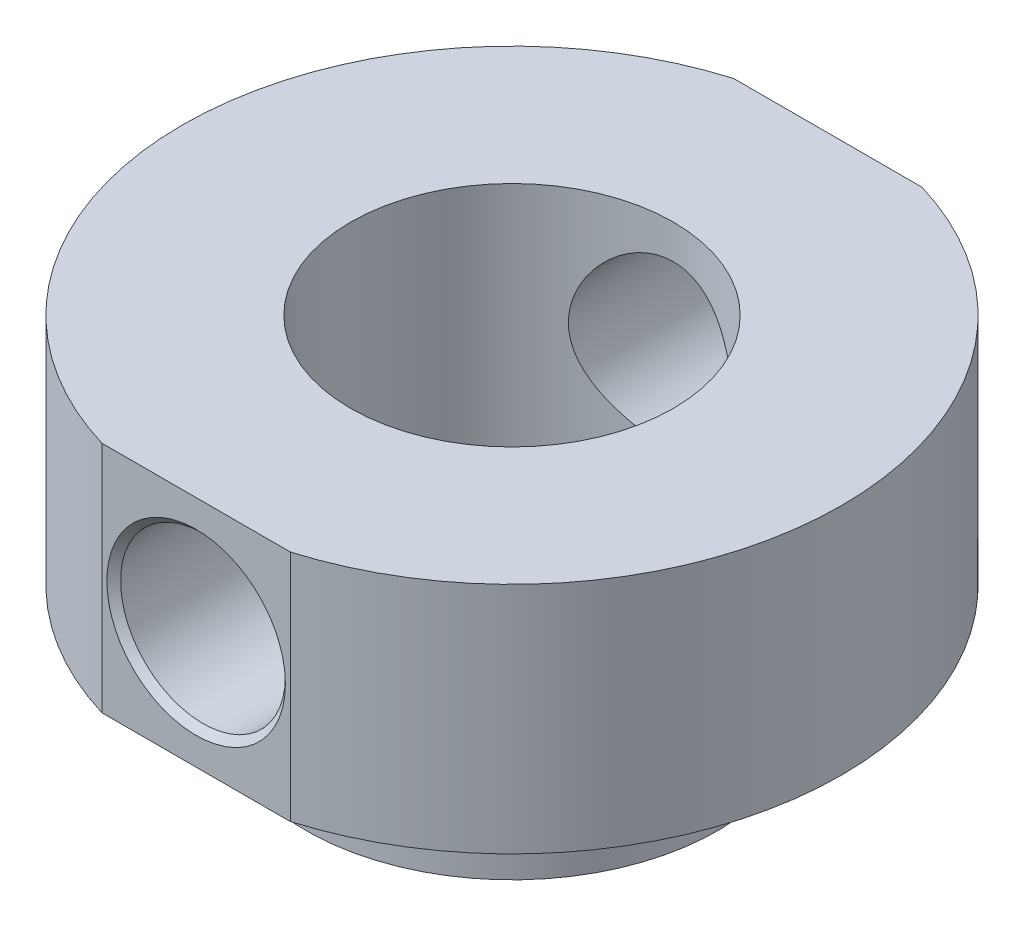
ISO-10303-21;
HEADER;
FILE_DESCRIPTION(('STEP AP214'),'2;1');
FILE_NAME('part.step','',(''),(''),'','','');
FILE_SCHEMA(('AUTOMOTIVE_DESIGN { 1 0 10303 214 1 1 1 1 }'));
ENDSEC;
DATA;
#1=APPLICATION_CONTEXT('core data for automotive mechanical design processes');
#2=APPLICATION_PROTOCOL_DEFINITION('international standard','automotive_design',2000,#1);
#3=PRODUCT_CONTEXT('',#1,'mechanical');
#4=PRODUCT('Part','Part','',(#3));
#5=PRODUCT_RELATED_PRODUCT_CATEGORY('part','',(#4));
#6=PRODUCT_DEFINITION_FORMATION('','',#4);
#7=PRODUCT_DEFINITION_CONTEXT('part definition',#1,'design');
#8=PRODUCT_DEFINITION('design','',#6,#7);
#9=PRODUCT_DEFINITION_SHAPE('','',#8);
#10=(LENGTH_UNIT() NAMED_UNIT(*) SI_UNIT(.MILLI.,.METRE.));
#11=(NAMED_UNIT(*) PLANE_ANGLE_UNIT() SI_UNIT($,.RADIAN.));
#12=(NAMED_UNIT(*) SI_UNIT($,.STERADIAN.) SOLID_ANGLE_UNIT());
#13=UNCERTAINTY_MEASURE_WITH_UNIT(LENGTH_MEASURE(1.E-05),#10,'distance_accuracy_value','');
#14=(GEOMETRIC_REPRESENTATION_CONTEXT(3) GLOBAL_UNCERTAINTY_ASSIGNED_CONTEXT((#13)) GLOBAL_UNIT_ASSIGNED_CONTEXT((#10,
#11,#12)) REPRESENTATION_CONTEXT('',''));
#15=CARTESIAN_POINT('',(0.,0.,0.));
#16=DIRECTION('',(0.,0.,1.));
#17=DIRECTION('',(1.,0.,0.));
#18=AXIS2_PLACEMENT_3D('',#15,#16,#17);
#19=CARTESIAN_POINT('',(11.7500000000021,0.,0.));
#20=DIRECTION('',(0.,-1.,0.));
#21=DIRECTION('',(0.,0.,-1.));
#22=AXIS2_PLACEMENT_3D('',#19,#20,#21);
#23=PLANE('',#22);
#24=CARTESIAN_POINT('',(0.,0.,0.));
#25=DIRECTION('',(0.,-1.,0.));
#26=DIRECTION('',(0.,0.,-1.));
#27=AXIS2_PLACEMENT_3D('',#24,#25,#26);
#28=CIRCLE('',#27,24.);
#29=CARTESIAN_POINT('',(6.85565460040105,0.,-23.));
#30=VERTEX_POINT('',#29);
#31=CARTESIAN_POINT('',(6.85565460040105,0.,23.));
#32=VERTEX_POINT('',#31);
#33=EDGE_CURVE('E95',#30,#32,#28,.T.);
#34=ORIENTED_EDGE('',*,*,#33,.T.);
#35=DIRECTION('',(1.,0.,0.));
#36=VECTOR('',#35,1.);
#37=CARTESIAN_POINT('',(25.446623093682,0.,23.0000000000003));
#38=LINE('',#37,#36);
#39=CARTESIAN_POINT('',(-6.85565460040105,0.,23.));
#40=VERTEX_POINT('',#39);
#41=EDGE_CURVE('E170',#40,#32,#38,.T.);
#42=ORIENTED_EDGE('',*,*,#41,.F.);
#43=CARTESIAN_POINT('',(-6.85565460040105,0.,-23.));
#44=VERTEX_POINT('',#43);
#45=EDGE_CURVE('E98',#40,#44,#28,.T.);
#46=ORIENTED_EDGE('',*,*,#45,.T.);
#47=DIRECTION('',(-1.,0.,0.));
#48=VECTOR('',#47,1.);
#49=CARTESIAN_POINT('',(25.446623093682,0.,-22.9999999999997));
#50=LINE('',#49,#48);
#51=EDGE_CURVE('E172',#30,#44,#50,.T.);
#52=ORIENTED_EDGE('',*,*,#51,.F.);
#53=EDGE_LOOP('',(#34,#42,#46,#52));
#54=FACE_BOUND('',#53,.T.);
#55=CARTESIAN_POINT('',(0.,0.,0.));
#56=DIRECTION('',(0.,-1.,0.));
#57=DIRECTION('',(0.,0.,-1.));
#58=AXIS2_PLACEMENT_3D('',#55,#56,#57);
#59=CIRCLE('',#58,15.);
#60=CARTESIAN_POINT('',(0.,0.,-15.));
#61=VERTEX_POINT('',#60);
#62=EDGE_CURVE('E177',#61,#61,#59,.T.);
#63=ORIENTED_EDGE('',*,*,#62,.F.);
#64=EDGE_LOOP('',(#63));
#65=FACE_BOUND('',#64,.T.);
#66=ADVANCED_FACE('F38',(#54,#65),#23,.T.);
#67=CARTESIAN_POINT('',(0.,0.,0.));
#68=DIRECTION('',(0.,-1.,0.));
#69=DIRECTION('',(0.,0.,-1.));
#70=AXIS2_PLACEMENT_3D('',#67,#68,#69);
#71=CYLINDRICAL_SURFACE('',#70,24.);
#72=ORIENTED_EDGE('',*,*,#45,.F.);
#73=DIRECTION('',(0.,-1.,0.));
#74=VECTOR('',#73,1.);
#75=CARTESIAN_POINT('',(-6.85565460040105,0.,23.));
#76=LINE('',#75,#74);
#77=CARTESIAN_POINT('',(-6.85565460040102,17.,23.));
#78=VERTEX_POINT('',#77);
#79=EDGE_CURVE('E165',#40,#78,#76,.F.);
#80=ORIENTED_EDGE('',*,*,#79,.T.);
#81=CARTESIAN_POINT('',(0.,17.,0.));
#82=DIRECTION('',(0.,-1.,0.));
#83=DIRECTION('',(0.,0.,-1.));
#84=AXIS2_PLACEMENT_3D('',#81,#82,#83);
#85=CIRCLE('',#84,24.);
#86=CARTESIAN_POINT('',(-6.85565460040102,17.,-23.));
#87=VERTEX_POINT('',#86);
#88=EDGE_CURVE('E99',#78,#87,#85,.T.);
#89=ORIENTED_EDGE('',*,*,#88,.T.);
#90=DIRECTION('',(0.,-1.,0.));
#91=VECTOR('',#90,1.);
#92=CARTESIAN_POINT('',(-6.85565460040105,0.,-23.));
#93=LINE('',#92,#91);
#94=EDGE_CURVE('E54',#87,#44,#93,.T.);
#95=ORIENTED_EDGE('',*,*,#94,.T.);
#96=EDGE_LOOP('',(#72,#80,#89,#95));
#97=FACE_BOUND('',#96,.T.);
#98=ADVANCED_FACE('F135',(#97),#71,.T.);
#99=CARTESIAN_POINT('',(6.85565460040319,17.,-22.9999999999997));
#100=VERTEX_POINT('',#99);
#101=CARTESIAN_POINT('',(6.85565460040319,17.,23.0000000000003));
#102=VERTEX_POINT('',#101);
#103=EDGE_CURVE('E93',#100,#102,#85,.T.);
#104=ORIENTED_EDGE('',*,*,#103,.T.);
#105=DIRECTION('',(0.,-1.,0.));
#106=VECTOR('',#105,1.);
#107=CARTESIAN_POINT('',(6.85565460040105,0.,23.));
#108=LINE('',#107,#106);
#109=EDGE_CURVE('E62',#102,#32,#108,.T.);
#110=ORIENTED_EDGE('',*,*,#109,.T.);
#111=ORIENTED_EDGE('',*,*,#33,.F.);
#112=DIRECTION('',(0.,-1.,0.));
#113=VECTOR('',#112,1.);
#114=CARTESIAN_POINT('',(6.85565460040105,0.,-23.));
#115=LINE('',#114,#113);
#116=EDGE_CURVE('E80',#30,#100,#115,.F.);
#117=ORIENTED_EDGE('',*,*,#116,.T.);
#118=EDGE_LOOP('',(#104,#110,#111,#117));
#119=FACE_BOUND('',#118,.T.);
#120=ADVANCED_FACE('F92',(#119),#71,.T.);
#121=CARTESIAN_POINT('',(24.,17.,1.0288742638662E-13));
#122=DIRECTION('',(0.,1.,0.));
#123=DIRECTION('',(0.,0.,1.));
#124=AXIS2_PLACEMENT_3D('',#121,#122,#123);
#125=PLANE('',#124);
#126=CARTESIAN_POINT('',(0.,17.,0.));
#127=DIRECTION('',(0.,-1.,0.));
#128=DIRECTION('',(0.,0.,-1.));
#129=AXIS2_PLACEMENT_3D('',#126,#127,#128);
#130=CIRCLE('',#129,11.75);
#131=CARTESIAN_POINT('',(0.,17.,-11.75));
#132=VERTEX_POINT('',#131);
#133=EDGE_CURVE('E103',#132,#132,#130,.T.);
#134=ORIENTED_EDGE('',*,*,#133,.T.);
#135=EDGE_LOOP('',(#134));
#136=FACE_BOUND('',#135,.T.);
#137=ORIENTED_EDGE('',*,*,#88,.F.);
#138=DIRECTION('',(1.,0.,0.));
#139=VECTOR('',#138,1.);
#140=CARTESIAN_POINT('',(25.446623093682,17.,23.0000000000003));
#141=LINE('',#140,#139);
#142=EDGE_CURVE('E86',#78,#102,#141,.T.);
#143=ORIENTED_EDGE('',*,*,#142,.T.);
#144=ORIENTED_EDGE('',*,*,#103,.F.);
#145=DIRECTION('',(-1.,0.,0.));
#146=VECTOR('',#145,1.);
#147=CARTESIAN_POINT('',(25.446623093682,17.,-22.9999999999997));
#148=LINE('',#147,#146);
#149=EDGE_CURVE('E77',#100,#87,#148,.T.);
#150=ORIENTED_EDGE('',*,*,#149,.T.);
#151=EDGE_LOOP('',(#137,#143,#144,#150));
#152=FACE_BOUND('',#151,.T.);
#153=ADVANCED_FACE('F97',(#136,#152),#125,.T.);
#154=CARTESIAN_POINT('',(0.,8.5,-24.));
#155=DIRECTION('',(0.,0.,1.));
#156=DIRECTION('',(1.,0.,0.));
#157=AXIS2_PLACEMENT_3D('',#154,#155,#156);
#158=CYLINDRICAL_SURFACE('',#157,6.);
#159=CARTESIAN_POINT('',(0.,8.5,22.5));
#160=DIRECTION('',(0.,0.,1.));
#161=DIRECTION('',(1.,0.,0.));
#162=AXIS2_PLACEMENT_3D('',#159,#160,#161);
#163=CIRCLE('',#162,6.);
#164=CARTESIAN_POINT('',(6.,8.5,22.5));
#165=VERTEX_POINT('',#164);
#166=EDGE_CURVE('E13',#165,#165,#163,.T.);
#167=ORIENTED_EDGE('',*,*,#166,.T.);
#168=EDGE_LOOP('',(#167));
#169=FACE_BOUND('',#168,.T.);
#170=CARTESIAN_POINT('',(6.00000000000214,8.49999999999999,10.1025986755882));
#171=CARTESIAN_POINT('',(5.99999963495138,8.34412689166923,10.1025991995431));
#172=CARTESIAN_POINT('',(5.99391794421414,8.18824646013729,10.1062183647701));
#173=CARTESIAN_POINT('',(5.96967428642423,7.87769736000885,10.1205574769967));
#174=CARTESIAN_POINT('',(5.95150702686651,7.72302925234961,10.1312805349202));
#175=CARTESIAN_POINT('',(5.90330542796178,7.41594368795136,10.1594420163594));
#176=CARTESIAN_POINT('',(5.87325345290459,7.26352992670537,10.1768904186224));
#177=CARTESIAN_POINT('',(5.80165388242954,6.96220643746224,10.2178770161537));
#178=CARTESIAN_POINT('',(5.76010126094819,6.81329827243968,10.2414178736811));
#179=CARTESIAN_POINT('',(5.66625141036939,6.52085045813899,10.2936366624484));
#180=CARTESIAN_POINT('',(5.6140200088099,6.37728400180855,10.3222829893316));
#181=CARTESIAN_POINT('',(5.49915594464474,6.09531936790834,10.3839315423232));
#182=CARTESIAN_POINT('',(5.43651924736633,5.95692322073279,10.4169354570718));
#183=CARTESIAN_POINT('',(5.23378538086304,5.55059353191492,10.5210764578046));
#184=CARTESIAN_POINT('',(5.07877840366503,5.29125359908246,10.5973929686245));
#185=CARTESIAN_POINT('',(4.71803482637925,4.77887253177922,10.7631481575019));
#186=CARTESIAN_POINT('',(4.50907628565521,4.52830310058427,10.8531508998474));
#187=CARTESIAN_POINT('',(4.05279758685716,4.06370572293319,11.0316455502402));
#188=CARTESIAN_POINT('',(3.8054577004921,3.84969668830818,11.1201366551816));
#189=CARTESIAN_POINT('',(3.39997419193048,3.55318590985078,11.2483246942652));
#190=CARTESIAN_POINT('',(3.25367202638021,3.45572919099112,11.2916157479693));
#191=CARTESIAN_POINT('',(2.95224914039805,3.27360663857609,11.3741412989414));
#192=CARTESIAN_POINT('',(2.79713198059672,3.18893569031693,11.4133774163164));
#193=CARTESIAN_POINT('',(2.4790763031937,3.03323400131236,11.4866580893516));
#194=CARTESIAN_POINT('',(2.31613995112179,2.96219951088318,11.520704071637));
#195=CARTESIAN_POINT('',(1.98356940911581,2.83456437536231,11.5825965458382));
#196=CARTESIAN_POINT('',(1.81393596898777,2.77796211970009,11.6104437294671));
#197=CARTESIAN_POINT('',(1.48204412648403,2.68355060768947,11.6572737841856));
#198=CARTESIAN_POINT('',(1.32016252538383,2.64466437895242,11.6767584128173));
#199=CARTESIAN_POINT('',(0.993092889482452,2.58041101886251,11.709110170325));
#200=CARTESIAN_POINT('',(0.827905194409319,2.55504250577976,11.721977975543));
#201=CARTESIAN_POINT('',(0.495678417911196,2.51817559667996,11.7407185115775));
#202=CARTESIAN_POINT('',(0.328640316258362,2.50667018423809,11.7465947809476));
#203=CARTESIAN_POINT('',(-0.00590694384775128,2.49767046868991,11.7511890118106));
#204=CARTESIAN_POINT('',(-0.173416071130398,2.500175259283,11.7499074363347));
#205=CARTESIAN_POINT('',(-0.492230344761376,2.51829125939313,11.740668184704));
#206=CARTESIAN_POINT('',(-0.643624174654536,2.53269024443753,11.7333280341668));
#207=CARTESIAN_POINT('',(-0.944553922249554,2.57287028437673,11.7129443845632));
#208=CARTESIAN_POINT('',(-1.09408924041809,2.59865491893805,11.6998990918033));
#209=CARTESIAN_POINT('',(-1.39018158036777,2.66131107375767,11.6684213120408));
#210=CARTESIAN_POINT('',(-1.53673958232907,2.69817887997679,11.6499906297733));
#211=CARTESIAN_POINT('',(-1.82605810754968,2.78263748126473,11.6081604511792));
#212=CARTESIAN_POINT('',(-1.96881715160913,2.83023238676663,11.5847590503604));
#213=CARTESIAN_POINT('',(-2.25147817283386,2.93637493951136,11.5331801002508));
#214=CARTESIAN_POINT('',(-2.39131956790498,2.99505591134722,11.5049448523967));
#215=CARTESIAN_POINT('',(-2.66549228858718,3.1224510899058,11.4445356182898));
#216=CARTESIAN_POINT('',(-2.79982160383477,3.19116891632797,11.4123602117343));
#217=CARTESIAN_POINT('',(-3.19351571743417,3.41160103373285,11.3109333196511));
#218=CARTESIAN_POINT('',(-3.44375867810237,3.57765913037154,11.2367485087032));
#219=CARTESIAN_POINT('',(-3.93829934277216,3.96157445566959,11.0736937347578));
#220=CARTESIAN_POINT('',(-4.17964012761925,4.18290293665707,10.9840971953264));
#221=CARTESIAN_POINT('',(-4.62353050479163,4.66208715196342,10.8047574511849));
#222=CARTESIAN_POINT('',(-4.82604802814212,4.91997278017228,10.7150141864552));
#223=CARTESIAN_POINT('',(-5.10327248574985,5.3397185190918,10.5844490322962));
#224=CARTESIAN_POINT('',(-5.19361048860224,5.49044185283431,10.5402900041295));
#225=CARTESIAN_POINT('',(-5.3611117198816,5.80010641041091,10.4560868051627));
#226=CARTESIAN_POINT('',(-5.43828089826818,5.95904388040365,10.4160407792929));
#227=CARTESIAN_POINT('',(-5.5786398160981,6.28412335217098,10.3415471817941));
#228=CARTESIAN_POINT('',(-5.64183812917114,6.45026086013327,10.3070961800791));
#229=CARTESIAN_POINT('',(-5.75352856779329,6.78867308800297,10.2451693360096));
#230=CARTESIAN_POINT('',(-5.80202278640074,6.96094693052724,10.2176925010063));
#231=CARTESIAN_POINT('',(-5.88031395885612,7.2962052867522,10.1728205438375));
#232=CARTESIAN_POINT('',(-5.91129760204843,7.45882826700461,10.1547940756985));
#233=CARTESIAN_POINT('',(-5.95975873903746,7.78674266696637,10.1264292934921));
#234=CARTESIAN_POINT('',(-5.97723701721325,7.95203393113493,10.116090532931));
#235=CARTESIAN_POINT('',(-5.99840038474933,8.28369594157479,10.1035560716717));
#236=CARTESIAN_POINT('',(-6.00209466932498,8.45006589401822,10.1013549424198));
#237=CARTESIAN_POINT('',(-5.9956527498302,8.78243543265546,10.1051800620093));
#238=CARTESIAN_POINT('',(-5.98551757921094,8.94843504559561,10.1112056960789));
#239=CARTESIAN_POINT('',(-5.95357460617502,9.2592284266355,10.1300414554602));
#240=CARTESIAN_POINT('',(-5.93326933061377,9.40423330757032,10.1419764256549));
#241=CARTESIAN_POINT('',(-5.8822488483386,9.69184163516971,10.1716527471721));
#242=CARTESIAN_POINT('',(-5.85153022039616,9.834444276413,10.1893960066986));
#243=CARTESIAN_POINT('',(-5.78002242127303,10.1163154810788,10.2301285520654));
#244=CARTESIAN_POINT('',(-5.7392344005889,10.2555844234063,10.2531172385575));
#245=CARTESIAN_POINT('',(-5.64798285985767,10.5300836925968,10.3036646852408));
#246=CARTESIAN_POINT('',(-5.59751555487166,10.6653124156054,10.3312252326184));
#247=CARTESIAN_POINT('',(-5.42718542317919,11.0760437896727,10.4223440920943));
#248=CARTESIAN_POINT('',(-5.291638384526,11.3437923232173,10.4923972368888));
#249=CARTESIAN_POINT('',(-4.98382696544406,11.854176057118,10.6420488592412));
#250=CARTESIAN_POINT('',(-4.81154367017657,12.0967982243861,10.7216522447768));
#251=CARTESIAN_POINT('',(-4.40847859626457,12.5838741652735,10.894127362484));
#252=CARTESIAN_POINT('',(-4.17296921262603,12.8243052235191,10.9873588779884));
#253=CARTESIAN_POINT('',(-3.66342968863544,13.2636457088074,11.1675695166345));
#254=CARTESIAN_POINT('',(-3.38938478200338,13.4625391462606,11.2545462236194));
#255=CARTESIAN_POINT('',(-2.94946039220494,13.7279377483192,11.3748590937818));
#256=CARTESIAN_POINT('',(-2.79541524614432,13.8119307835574,11.4137844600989));
#257=CARTESIAN_POINT('',(-2.47959886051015,13.9664840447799,11.4865261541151));
#258=CARTESIAN_POINT('',(-2.31783109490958,14.0370502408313,11.5203447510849));
#259=CARTESIAN_POINT('',(-1.98776828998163,14.1639235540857,11.5818589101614));
#260=CARTESIAN_POINT('',(-1.81947658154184,14.2202378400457,11.6095575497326));
#261=CARTESIAN_POINT('',(-1.47763410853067,14.317918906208,11.657996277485));
#262=CARTESIAN_POINT('',(-1.30408400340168,14.3592875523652,11.6787372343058));
#263=CARTESIAN_POINT('',(-0.969806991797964,14.4233140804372,11.7109975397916));
#264=CARTESIAN_POINT('',(-0.809412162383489,14.4473674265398,11.7232015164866));
#265=CARTESIAN_POINT('',(-0.486843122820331,14.4824155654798,11.7410206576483));
#266=CARTESIAN_POINT('',(-0.324669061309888,14.4934114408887,11.7466363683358));
#267=CARTESIAN_POINT('',(7.7351891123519E-05,14.5021977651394,11.7511218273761));
#268=CARTESIAN_POINT('',(0.162649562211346,14.4999923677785,11.7499936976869));
#269=CARTESIAN_POINT('',(0.486890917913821,14.4824154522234,11.7410279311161));
#270=CARTESIAN_POINT('',(0.648560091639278,14.4670443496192,11.7331905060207));
#271=CARTESIAN_POINT('',(0.95828830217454,14.4248928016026,11.711812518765));
#272=CARTESIAN_POINT('',(1.10649982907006,14.3989982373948,11.6987155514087));
#273=CARTESIAN_POINT('',(1.4000694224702,14.336295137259,11.6672235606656));
#274=CARTESIAN_POINT('',(1.54542656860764,14.2994831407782,11.6488268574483));
#275=CARTESIAN_POINT('',(1.83229227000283,14.2153340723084,11.6071619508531));
#276=CARTESIAN_POINT('',(1.97380191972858,14.1680000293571,11.5838951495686));
#277=CARTESIAN_POINT('',(2.25226949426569,14.0632207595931,11.5329887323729));
#278=CARTESIAN_POINT('',(2.38922562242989,14.0057715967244,11.5053474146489));
#279=CARTESIAN_POINT('',(2.66335569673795,13.8786879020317,11.4450655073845));
#280=CARTESIAN_POINT('',(2.80030795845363,13.8086500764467,11.4122663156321));
#281=CARTESIAN_POINT('',(3.0678174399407,13.6586850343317,11.3432847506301));
#282=CARTESIAN_POINT('',(3.19837246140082,13.5787544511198,11.3071012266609));
#283=CARTESIAN_POINT('',(3.57952577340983,13.3249482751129,11.194620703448));
#284=CARTESIAN_POINT('',(3.81974647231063,13.1369955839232,11.1143630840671));
#285=CARTESIAN_POINT('',(4.29150573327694,12.7065653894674,10.9414344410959));
#286=CARTESIAN_POINT('',(4.51959231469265,12.4604633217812,10.8483369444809));
#287=CARTESIAN_POINT('',(4.82913721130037,12.0647682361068,10.7123630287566));
#288=CARTESIAN_POINT('',(4.92695834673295,11.928316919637,10.6676134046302));
#289=CARTESIAN_POINT('',(5.11117911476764,11.6470763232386,10.580581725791));
#290=CARTESIAN_POINT('',(5.19757707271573,11.5022858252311,10.5383000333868));
#291=CARTESIAN_POINT('',(5.36136538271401,11.1993610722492,10.4559550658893));
#292=CARTESIAN_POINT('',(5.43827760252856,11.0409272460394,10.4160410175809));
#293=CARTESIAN_POINT('',(5.57822598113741,10.7168714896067,10.3417683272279));
#294=CARTESIAN_POINT('',(5.64126929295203,10.5512533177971,10.3074068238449));
#295=CARTESIAN_POINT('',(5.75260325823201,10.2143367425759,10.2456870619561));
#296=CARTESIAN_POINT('',(5.80093155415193,10.0430540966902,10.2183109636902));
#297=CARTESIAN_POINT('',(5.88230862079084,9.69590538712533,10.171684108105));
#298=CARTESIAN_POINT('',(5.91536790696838,9.52004256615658,10.1524277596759));
#299=CARTESIAN_POINT('',(5.96027525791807,9.20349299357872,10.1261112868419));
#300=CARTESIAN_POINT('',(5.97515545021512,9.06337195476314,10.1173191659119));
#301=CARTESIAN_POINT('',(5.99501831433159,8.78216931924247,10.1055624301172));
#302=CARTESIAN_POINT('',(6.00000033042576,8.64108765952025,10.1025982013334));
#303=CARTESIAN_POINT('',(6.00000000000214,8.49999999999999,10.1025986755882));
#304=B_SPLINE_CURVE_WITH_KNOTS('',3,(#170,#171,#172,#173,#174,#175,#176,#177,#178,#179,#180,
#181,#182,#183,#184,#185,#186,#187,#188,#189,#190,#191,#192,#193,#194,#195,#196,#197,#198,#199,
#200,#201,#202,#203,#204,#205,#206,#207,#208,#209,#210,#211,#212,#213,#214,#215,#216,#217,#218,
#219,#220,#221,#222,#223,#224,#225,#226,#227,#228,#229,#230,#231,#232,#233,#234,#235,#236,#237,
#238,#239,#240,#241,#242,#243,#244,#245,#246,#247,#248,#249,#250,#251,#252,#253,#254,#255,#256,
#257,#258,#259,#260,#261,#262,#263,#264,#265,#266,#267,#268,#269,#270,#271,#272,#273,#274,#275,
#276,#277,#278,#279,#280,#281,#282,#283,#284,#285,#286,#287,#288,#289,#290,#291,#292,#293,#294,
#295,#296,#297,#298,#299,#300,#301,#302,#303),.UNSPECIFIED.,.T.,.F.,(4,2,2,2,2,2,2,2,2,2,2,2,2,
2,2,2,2,2,2,2,2,2,2,2,2,2,2,2,2,2,2,2,2,2,2,2,2,2,2,2,2,2,2,2,2,2,2,2,2,2,2,2,2,2,2,2,2,2,2,2,2,
2,2,2,2,2,4),(0.,0.467473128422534,0.935151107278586,1.40352569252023,1.87210529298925,
2.33787908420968,2.8038339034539,3.73490312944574,4.74626222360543,5.75814289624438,
6.30067512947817,6.84298975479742,7.385155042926,7.92725980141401,8.42944389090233,
8.93157663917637,9.43345513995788,9.93530117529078,10.3915236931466,10.8478897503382,
11.3041030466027,11.7604914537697,12.2227651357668,12.6852059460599,13.6095331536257,
14.6239549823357,15.639211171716,16.1821804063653,16.7249036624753,17.2672929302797,
17.8096049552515,18.3084689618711,18.8073039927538,19.305806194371,19.8042711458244,
20.2444835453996,20.6848407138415,21.1251475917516,21.565626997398,22.4861931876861,
23.4072345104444,24.4504002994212,25.4939669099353,26.0325154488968,26.5708239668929,
27.1088611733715,27.6468311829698,28.1341243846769,28.6213771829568,29.1084766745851,
29.5955607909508,30.0481217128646,30.5008262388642,30.9534006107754,31.4061514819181,
31.8774812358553,32.3489718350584,33.2915042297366,34.3312667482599,34.8520479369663,
35.3729053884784,35.9139246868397,36.4546642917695,36.9940087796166,37.5329812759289,
37.9560838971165,38.3792145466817),.UNSPECIFIED.);
#305=CARTESIAN_POINT('',(6.00000000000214,8.49999999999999,10.1025986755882));
#306=VERTEX_POINT('',#305);
#307=EDGE_CURVE('E160',#306,#306,#304,.T.);
#308=ORIENTED_EDGE('',*,*,#307,.T.);
#309=EDGE_LOOP('',(#308));
#310=FACE_BOUND('',#309,.T.);
#311=ADVANCED_FACE('F147',(#169,#310),#158,.F.);
#312=CARTESIAN_POINT('',(0.,8.5,-22.5));
#313=DIRECTION('',(0.,0.,-1.));
#314=DIRECTION('',(-1.,0.,0.));
#315=AXIS2_PLACEMENT_3D('',#312,#313,#314);
#316=CIRCLE('',#315,6.);
#317=CARTESIAN_POINT('',(-6.,8.5,-22.5));
#318=VERTEX_POINT('',#317);
#319=EDGE_CURVE('E110',#318,#318,#316,.T.);
#320=ORIENTED_EDGE('',*,*,#319,.T.);
#321=EDGE_LOOP('',(#320));
#322=FACE_BOUND('',#321,.T.);
#323=CARTESIAN_POINT('',(0.,14.5,-11.7500000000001));
#324=CARTESIAN_POINT('',(-0.157379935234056,14.4999997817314,-11.7499997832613));
#325=CARTESIAN_POINT('',(-0.314764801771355,14.4938010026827,-11.7468309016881));
#326=CARTESIAN_POINT('',(-0.628370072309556,14.46907894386,-11.7342358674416));
#327=CARTESIAN_POINT('',(-0.784589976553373,14.4505506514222,-11.7248071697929));
#328=CARTESIAN_POINT('',(-1.09483052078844,14.4013596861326,-11.6999186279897));
#329=CARTESIAN_POINT('',(-1.24884795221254,14.37068087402,-11.6844507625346));
#330=CARTESIAN_POINT('',(-1.553429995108,14.2975339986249,-11.6478709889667));
#331=CARTESIAN_POINT('',(-1.70399316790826,14.255061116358,-11.6267567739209));
#332=CARTESIAN_POINT('',(-1.99996915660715,14.158994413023,-11.5795066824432));
#333=CARTESIAN_POINT('',(-2.14540171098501,14.1054503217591,-11.5533932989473));
#334=CARTESIAN_POINT('',(-2.43097829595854,13.9876441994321,-11.4966988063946));
#335=CARTESIAN_POINT('',(-2.57112030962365,13.9233781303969,-11.4661160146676));
#336=CARTESIAN_POINT('',(-2.98231509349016,13.7153605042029,-11.3687022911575));
#337=CARTESIAN_POINT('',(-3.24445421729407,13.5562853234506,-11.2961530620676));
#338=CARTESIAN_POINT('',(-3.75511093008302,13.1908411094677,-11.1372232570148));
#339=CARTESIAN_POINT('',(-4.0017620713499,12.9821428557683,-11.0502625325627));
#340=CARTESIAN_POINT('',(-4.45841751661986,12.5281662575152,-10.8740472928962));
#341=CARTESIAN_POINT('',(-4.66839259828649,12.2828590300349,-10.7847910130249));
#342=CARTESIAN_POINT('',(-4.96018300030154,11.8804026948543,-10.6523150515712));
#343=CARTESIAN_POINT('',(-5.05661893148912,11.7344004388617,-10.606750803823));
#344=CARTESIAN_POINT('',(-5.2367422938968,11.4338014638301,-10.5189850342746));
#345=CARTESIAN_POINT('',(-5.32043513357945,11.2792084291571,-10.4767820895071));
#346=CARTESIAN_POINT('',(-5.47432921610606,10.9622668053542,-10.3971984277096));
#347=CARTESIAN_POINT('',(-5.54453140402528,10.79991876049,-10.3598173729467));
#348=CARTESIAN_POINT('',(-5.6706370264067,10.4685700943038,-10.2913326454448));
#349=CARTESIAN_POINT('',(-5.72654908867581,10.2995735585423,-10.2602251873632));
#350=CARTESIAN_POINT('',(-5.82043836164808,9.966493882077,-10.2072390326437));
#351=CARTESIAN_POINT('',(-5.8592939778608,9.80272927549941,-10.18491683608));
#352=CARTESIAN_POINT('',(-5.9231815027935,9.47175342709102,-10.147895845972));
#353=CARTESIAN_POINT('',(-5.94822090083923,9.30454410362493,-10.1331929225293));
#354=CARTESIAN_POINT('',(-5.98409357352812,8.96819754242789,-10.1120502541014));
#355=CARTESIAN_POINT('',(-5.99493630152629,8.79906166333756,-10.1056050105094));
#356=CARTESIAN_POINT('',(-6.0022588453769,8.46037736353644,-10.1012578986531));
#357=CARTESIAN_POINT('',(-5.99874013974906,8.29082898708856,-10.1033551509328));
#358=CARTESIAN_POINT('',(-5.97875881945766,7.97434216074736,-10.1151889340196));
#359=CARTESIAN_POINT('',(-5.96398901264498,7.82725538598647,-10.1239260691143));
#360=CARTESIAN_POINT('',(-5.92372850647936,7.53501075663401,-10.147535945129));
#361=CARTESIAN_POINT('',(-5.8982344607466,7.38985351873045,-10.1624106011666));
#362=CARTESIAN_POINT('',(-5.83682461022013,7.10248051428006,-10.1978052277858));
#363=CARTESIAN_POINT('',(-5.80090987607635,6.96026444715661,-10.2183246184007));
#364=CARTESIAN_POINT('',(-5.71903966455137,6.67956255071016,-10.2643696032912));
#365=CARTESIAN_POINT('',(-5.67308023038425,6.54107821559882,-10.2898971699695));
#366=CARTESIAN_POINT('',(-5.51843482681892,6.12614587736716,-10.3741704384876));
#367=CARTESIAN_POINT('',(-5.39436452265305,5.85664528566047,-10.4397668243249));
#368=CARTESIAN_POINT('',(-5.10963272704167,5.34111015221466,-10.5820323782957));
#369=CARTESIAN_POINT('',(-4.94895478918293,5.09508622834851,-10.6587065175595));
#370=CARTESIAN_POINT('',(-4.5706721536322,4.59887440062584,-10.8268087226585));
#371=CARTESIAN_POINT('',(-4.34833831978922,4.35248507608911,-10.9188427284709));
#372=CARTESIAN_POINT('',(-3.86505029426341,3.89878659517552,-11.0991101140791));
#373=CARTESIAN_POINT('',(-3.60407622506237,3.69149767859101,-11.1873415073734));
#374=CARTESIAN_POINT('',(-3.18071755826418,3.40943803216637,-11.3123292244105));
#375=CARTESIAN_POINT('',(-3.03026256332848,3.31843788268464,-11.3536555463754));
#376=CARTESIAN_POINT('',(-2.72103527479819,3.14958351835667,-11.4317032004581));
#377=CARTESIAN_POINT('',(-2.56226653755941,3.07172374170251,-11.4684264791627));
#378=CARTESIAN_POINT('',(-2.23751531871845,2.92999938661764,-11.5361838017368));
#379=CARTESIAN_POINT('',(-2.07153593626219,2.86612886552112,-11.5672202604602));
#380=CARTESIAN_POINT('',(-1.73355909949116,2.7531307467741,-11.6226752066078));
#381=CARTESIAN_POINT('',(-1.56156237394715,2.7040013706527,-11.6470944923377));
#382=CARTESIAN_POINT('',(-1.22786941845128,2.6246961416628,-11.6867712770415));
#383=CARTESIAN_POINT('',(-1.06654295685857,2.59326272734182,-11.7026317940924));
#384=CARTESIAN_POINT('',(-0.741353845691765,2.54370607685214,-11.7277226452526));
#385=CARTESIAN_POINT('',(-0.577491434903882,2.52558159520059,-11.7369535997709));
#386=CARTESIAN_POINT('',(-0.248654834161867,2.50289041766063,-11.748520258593));
#387=CARTESIAN_POINT('',(-0.0836811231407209,2.49831821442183,-11.7508587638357));
#388=CARTESIAN_POINT('',(0.246030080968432,2.50278005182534,-11.7485804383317));
#389=CARTESIAN_POINT('',(0.41076758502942,2.51181343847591,-11.7439639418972));
#390=CARTESIAN_POINT('',(0.725166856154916,2.5420644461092,-11.7285696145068));
#391=CARTESIAN_POINT('',(0.87495832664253,2.56222358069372,-11.7183273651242));
#392=CARTESIAN_POINT('',(1.17217824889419,2.61368102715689,-11.6923375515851));
#393=CARTESIAN_POINT('',(1.31960593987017,2.64498285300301,-11.6765882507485));
#394=CARTESIAN_POINT('',(1.6110411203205,2.71838069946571,-11.6399575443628));
#395=CARTESIAN_POINT('',(1.75504966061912,2.76047335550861,-11.6190777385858));
#396=CARTESIAN_POINT('',(2.03888772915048,2.8550618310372,-11.5726457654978));
#397=CARTESIAN_POINT('',(2.17871560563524,2.90756170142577,-11.5470917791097));
#398=CARTESIAN_POINT('',(2.45712253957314,3.02405897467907,-11.491116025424));
#399=CARTESIAN_POINT('',(2.59556425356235,3.0883301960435,-11.4605807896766));
#400=CARTESIAN_POINT('',(2.8665014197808,3.22682827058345,-11.3958370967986));
#401=CARTESIAN_POINT('',(2.99899483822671,3.30105849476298,-11.3616273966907));
#402=CARTESIAN_POINT('',(3.38658319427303,3.53787675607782,-11.2545658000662));
#403=CARTESIAN_POINT('',(3.63193333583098,3.71465445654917,-11.1772506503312));
#404=CARTESIAN_POINT('',(4.11570550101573,4.1215566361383,-11.0088871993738));
#405=CARTESIAN_POINT('',(4.35090547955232,4.35527188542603,-10.9172412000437));
#406=CARTESIAN_POINT('',(4.67272371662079,4.73263124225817,-10.7815488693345));
#407=CARTESIAN_POINT('',(4.77489780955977,4.86298993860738,-10.7365811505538));
#408=CARTESIAN_POINT('',(4.96841458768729,5.13216434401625,-10.6484103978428));
#409=CARTESIAN_POINT('',(5.05975558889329,5.27098136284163,-10.6052076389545));
#410=CARTESIAN_POINT('',(5.23562496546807,5.56418107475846,-10.5195448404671));
#411=CARTESIAN_POINT('',(5.31950992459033,5.71899979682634,-10.4772538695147));
#412=CARTESIAN_POINT('',(5.47372042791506,6.03636689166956,-10.3975198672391));
#413=CARTESIAN_POINT('',(5.5440525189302,6.19891148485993,-10.3600744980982));
#414=CARTESIAN_POINT('',(5.67036414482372,6.53062496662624,-10.2914837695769));
#415=CARTESIAN_POINT('',(5.72635572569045,6.69978815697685,-10.2603331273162));
#416=CARTESIAN_POINT('',(5.82328828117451,7.04356889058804,-10.2056318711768));
#417=CARTESIAN_POINT('',(5.86423170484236,7.21818554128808,-10.1820800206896));
#418=CARTESIAN_POINT('',(5.92719926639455,7.55415677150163,-10.1455408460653));
#419=CARTESIAN_POINT('',(5.95067443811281,7.71515273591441,-10.1317497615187));
#420=CARTESIAN_POINT('',(5.98447704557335,8.03899050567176,-10.1118210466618));
#421=CARTESIAN_POINT('',(5.99480539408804,8.20183218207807,-10.1056828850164));
#422=CARTESIAN_POINT('',(6.00214959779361,8.52785147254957,-10.1013226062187));
#423=CARTESIAN_POINT('',(5.99917112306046,8.69102891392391,-10.1030971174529));
#424=CARTESIAN_POINT('',(5.97996325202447,9.01631797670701,-10.1144779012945));
#425=CARTESIAN_POINT('',(5.96373449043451,9.17842964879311,-10.1240837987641));
#426=CARTESIAN_POINT('',(5.92063511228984,9.48350966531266,-10.1493413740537));
#427=CARTESIAN_POINT('',(5.89504144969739,9.62672103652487,-10.1642634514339));
#428=CARTESIAN_POINT('',(5.8337097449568,9.91028417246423,-10.1995867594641));
#429=CARTESIAN_POINT('',(5.79796835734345,10.0506349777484,-10.2199897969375));
#430=CARTESIAN_POINT('',(5.67605300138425,10.4661131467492,-10.2885229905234));
#431=CARTESIAN_POINT('',(5.57516027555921,10.7358575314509,-10.3439943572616));
#432=CARTESIAN_POINT('',(5.32960105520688,11.2727912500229,-10.4727355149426));
#433=CARTESIAN_POINT('',(5.18246177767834,11.5386076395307,-10.5469463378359));
#434=CARTESIAN_POINT('',(4.85124157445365,12.043549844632,-10.7033430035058));
#435=CARTESIAN_POINT('',(4.66714105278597,12.282661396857,-10.7855330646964));
#436=CARTESIAN_POINT('',(4.23930658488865,12.7595180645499,-10.9613268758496));
#437=CARTESIAN_POINT('',(3.99094730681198,12.9931272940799,-11.0550382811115));
#438=CARTESIAN_POINT('',(3.59020374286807,13.3103626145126,-11.1889647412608));
#439=CARTESIAN_POINT('',(3.45179191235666,13.41064916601,-11.2325343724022));
#440=CARTESIAN_POINT('',(3.16622649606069,13.5994373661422,-11.3163421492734));
#441=CARTESIAN_POINT('',(3.01907690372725,13.6879443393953,-11.3565817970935));
#442=CARTESIAN_POINT('',(2.71493295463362,13.8534566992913,-11.433133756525));
#443=CARTESIAN_POINT('',(2.55783778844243,13.9303028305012,-11.4693900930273));
#444=CARTESIAN_POINT('',(2.23659759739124,14.0703057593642,-11.5363350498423));
#445=CARTESIAN_POINT('',(2.07245608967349,14.133469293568,-11.5670264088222));
#446=CARTESIAN_POINT('',(1.73863230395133,14.2452654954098,-11.6218848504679));
#447=CARTESIAN_POINT('',(1.56896270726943,14.2939291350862,-11.6460658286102));
#448=CARTESIAN_POINT('',(1.22524510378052,14.3762209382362,-11.6872237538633));
#449=CARTESIAN_POINT('',(1.05119976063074,14.4098580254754,-11.7042049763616));
#450=CARTESIAN_POINT('',(0.731084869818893,14.4570887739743,-11.7281318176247));
#451=CARTESIAN_POINT('',(0.585468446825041,14.4731645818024,-11.7363159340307));
#452=CARTESIAN_POINT('',(0.293236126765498,14.4946204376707,-11.7472501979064));
#453=CARTESIAN_POINT('',(0.14662020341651,14.500000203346,-11.750000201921));
#454=CARTESIAN_POINT('',(0.,14.5,-11.7500000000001));
#455=B_SPLINE_CURVE_WITH_KNOTS('',3,(#323,#324,#325,#326,#327,#328,#329,#330,#331,#332,#333,
#334,#335,#336,#337,#338,#339,#340,#341,#342,#343,#344,#345,#346,#347,#348,#349,#350,#351,#352,
#353,#354,#355,#356,#357,#358,#359,#360,#361,#362,#363,#364,#365,#366,#367,#368,#369,#370,#371,
#372,#373,#374,#375,#376,#377,#378,#379,#380,#381,#382,#383,#384,#385,#386,#387,#388,#389,#390,
#391,#392,#393,#394,#395,#396,#397,#398,#399,#400,#401,#402,#403,#404,#405,#406,#407,#408,#409,
#410,#411,#412,#413,#414,#415,#416,#417,#418,#419,#420,#421,#422,#423,#424,#425,#426,#427,#428,
#429,#430,#431,#432,#433,#434,#435,#436,#437,#438,#439,#440,#441,#442,#443,#444,#445,#446,#447,
#448,#449,#450,#451,#452,#453,#454),.UNSPECIFIED.,.T.,.F.,(4,2,2,2,2,2,2,2,2,2,2,2,2,2,2,2,2,2,
2,2,2,2,2,2,2,2,2,2,2,2,2,2,2,2,2,2,2,2,2,2,2,2,2,2,2,2,2,2,2,2,2,2,2,2,2,2,2,2,2,2,2,2,2,2,2,
4),(0.,0.471995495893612,0.944183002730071,1.41699982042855,1.8900101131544,2.36094017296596,
2.83204799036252,3.77325990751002,4.77311721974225,5.77376758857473,6.31563210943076,
6.85726600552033,7.39886194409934,7.94013011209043,8.44874843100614,8.9570907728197,
9.46509444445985,9.97304581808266,10.4167745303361,10.8606418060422,11.3044634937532,
11.74846032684,12.6561143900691,13.564177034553,14.5930189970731,15.6223920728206,
16.1636597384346,16.7046977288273,17.2455054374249,17.7862478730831,18.2809520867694,
18.7756099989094,19.2700668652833,19.7644999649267,20.2184388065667,20.6725209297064,
21.1264616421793,21.5805793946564,22.047045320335,22.5136695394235,23.4464354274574,
24.4737319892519,24.9881523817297,25.5026526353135,26.0452183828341,26.5875213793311,
27.1293673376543,27.6711250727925,28.1602780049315,28.6493969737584,29.138307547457,
29.6271947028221,30.0654235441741,30.5037970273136,31.3799686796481,32.3146368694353,
33.2498019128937,34.3053146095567,34.8339717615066,35.3623891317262,35.8974754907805,
36.4322978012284,36.9659693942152,37.499323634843,37.9390381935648,38.3787643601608),.UNSPECIFIED.);
#456=CARTESIAN_POINT('',(0.,14.5,-11.7500000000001));
#457=VERTEX_POINT('',#456);
#458=EDGE_CURVE('E156',#457,#457,#455,.T.);
#459=ORIENTED_EDGE('',*,*,#458,.T.);
#460=EDGE_LOOP('',(#459));
#461=FACE_BOUND('',#460,.T.);
#462=ADVANCED_FACE('F152',(#322,#461),#158,.F.);
#463=CARTESIAN_POINT('',(0.,0.,0.));
#464=DIRECTION('',(0.,-1.,0.));
#465=DIRECTION('',(0.,0.,-1.));
#466=AXIS2_PLACEMENT_3D('',#463,#464,#465);
#467=CYLINDRICAL_SURFACE('',#466,11.75);
#468=ORIENTED_EDGE('',*,*,#458,.F.);
#469=EDGE_LOOP('',(#468));
#470=FACE_BOUND('',#469,.T.);
#471=ORIENTED_EDGE('',*,*,#307,.F.);
#472=EDGE_LOOP('',(#471));
#473=FACE_BOUND('',#472,.T.);
#474=ORIENTED_EDGE('',*,*,#133,.F.);
#475=EDGE_LOOP('',(#474));
#476=FACE_BOUND('',#475,.T.);
#477=CARTESIAN_POINT('',(2.13717932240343E-12,-8.00000000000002,0.));
#478=DIRECTION('',(0.,-1.,0.));
#479=DIRECTION('',(0.,0.,-1.));
#480=AXIS2_PLACEMENT_3D('',#477,#478,#479);
#481=CIRCLE('',#480,11.75);
#482=CARTESIAN_POINT('',(2.08579899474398E-12,-8.00000000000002,-11.75));
#483=VERTEX_POINT('',#482);
#484=EDGE_CURVE('E180',#483,#483,#481,.T.);
#485=ORIENTED_EDGE('',*,*,#484,.T.);
#486=EDGE_LOOP('',(#485));
#487=FACE_BOUND('',#486,.T.);
#488=ADVANCED_FACE('F40',(#470,#473,#476,#487),#467,.F.);
#489=CARTESIAN_POINT('',(25.446623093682,0.,-22.9999999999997));
#490=DIRECTION('',(0.,0.,-1.));
#491=DIRECTION('',(-1.,0.,0.));
#492=AXIS2_PLACEMENT_3D('',#489,#490,#491);
#493=PLANE('',#492);
#494=CARTESIAN_POINT('',(0.,8.5,-23.));
#495=DIRECTION('',(0.,0.,-1.));
#496=DIRECTION('',(-1.,0.,0.));
#497=AXIS2_PLACEMENT_3D('',#494,#495,#496);
#498=CIRCLE('',#497,6.5);
#499=CARTESIAN_POINT('',(-6.5,8.5,-23.));
#500=VERTEX_POINT('',#499);
#501=EDGE_CURVE('E107',#500,#500,#498,.F.);
#502=ORIENTED_EDGE('',*,*,#501,.T.);
#503=EDGE_LOOP('',(#502));
#504=FACE_BOUND('',#503,.T.);
#505=ORIENTED_EDGE('',*,*,#51,.T.);
#506=ORIENTED_EDGE('',*,*,#94,.F.);
#507=ORIENTED_EDGE('',*,*,#149,.F.);
#508=ORIENTED_EDGE('',*,*,#116,.F.);
#509=EDGE_LOOP('',(#505,#506,#507,#508));
#510=FACE_BOUND('',#509,.T.);
#511=ADVANCED_FACE('F79',(#504,#510),#493,.T.);
#512=CARTESIAN_POINT('',(25.446623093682,0.,23.0000000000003));
#513=DIRECTION('',(0.,0.,1.));
#514=DIRECTION('',(1.,0.,0.));
#515=AXIS2_PLACEMENT_3D('',#512,#513,#514);
#516=PLANE('',#515);
#517=CARTESIAN_POINT('',(0.,8.5,23.));
#518=DIRECTION('',(0.,0.,1.));
#519=DIRECTION('',(1.,0.,0.));
#520=AXIS2_PLACEMENT_3D('',#517,#518,#519);
#521=CIRCLE('',#520,6.5);
#522=CARTESIAN_POINT('',(6.5,8.5,23.));
#523=VERTEX_POINT('',#522);
#524=EDGE_CURVE('E47',#523,#523,#521,.F.);
#525=ORIENTED_EDGE('',*,*,#524,.T.);
#526=EDGE_LOOP('',(#525));
#527=FACE_BOUND('',#526,.T.);
#528=ORIENTED_EDGE('',*,*,#41,.T.);
#529=ORIENTED_EDGE('',*,*,#109,.F.);
#530=ORIENTED_EDGE('',*,*,#142,.F.);
#531=ORIENTED_EDGE('',*,*,#79,.F.);
#532=EDGE_LOOP('',(#528,#529,#530,#531));
#533=FACE_BOUND('',#532,.T.);
#534=ADVANCED_FACE('F115',(#527,#533),#516,.T.);
#535=CARTESIAN_POINT('',(0.,8.5,-23.));
#536=DIRECTION('',(0.,0.,-1.));
#537=DIRECTION('',(-1.,0.,0.));
#538=AXIS2_PLACEMENT_3D('',#535,#536,#537);
#539=CONICAL_SURFACE('',#538,6.5,0.785398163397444);
#540=ORIENTED_EDGE('',*,*,#319,.F.);
#541=EDGE_LOOP('',(#540));
#542=FACE_BOUND('',#541,.T.);
#543=ORIENTED_EDGE('',*,*,#501,.F.);
#544=EDGE_LOOP('',(#543));
#545=FACE_BOUND('',#544,.T.);
#546=ADVANCED_FACE('F120',(#542,#545),#539,.F.);
#547=CARTESIAN_POINT('',(0.,8.5,23.));
#548=DIRECTION('',(0.,0.,1.));
#549=DIRECTION('',(1.,0.,0.));
#550=AXIS2_PLACEMENT_3D('',#547,#548,#549);
#551=CONICAL_SURFACE('',#550,6.5,0.785398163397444);
#552=ORIENTED_EDGE('',*,*,#166,.F.);
#553=EDGE_LOOP('',(#552));
#554=FACE_BOUND('',#553,.T.);
#555=ORIENTED_EDGE('',*,*,#524,.F.);
#556=EDGE_LOOP('',(#555));
#557=FACE_BOUND('',#556,.T.);
#558=ADVANCED_FACE('F117',(#554,#557),#551,.F.);
#559=CARTESIAN_POINT('',(2.13717932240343E-12,-8.00000000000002,0.));
#560=DIRECTION('',(0.,-1.,0.));
#561=DIRECTION('',(0.,0.,-1.));
#562=AXIS2_PLACEMENT_3D('',#559,#560,#561);
#563=PLANE('',#562);
#564=CARTESIAN_POINT('',(2.13717932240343E-12,-8.00000000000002,0.));
#565=DIRECTION('',(0.,-1.,0.));
#566=DIRECTION('',(0.,0.,-1.));
#567=AXIS2_PLACEMENT_3D('',#564,#565,#566);
#568=CIRCLE('',#567,15.);
#569=CARTESIAN_POINT('',(2.07158741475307E-12,-8.00000000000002,-15.));
#570=VERTEX_POINT('',#569);
#571=EDGE_CURVE('E87',#570,#570,#568,.T.);
#572=ORIENTED_EDGE('',*,*,#571,.T.);
#573=EDGE_LOOP('',(#572));
#574=FACE_BOUND('',#573,.T.);
#575=ORIENTED_EDGE('',*,*,#484,.F.);
#576=EDGE_LOOP('',(#575));
#577=FACE_BOUND('',#576,.T.);
#578=ADVANCED_FACE('F119',(#574,#577),#563,.T.);
#579=CARTESIAN_POINT('',(2.13717932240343E-12,-8.00000000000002,0.));
#580=DIRECTION('',(0.,1.,0.));
#581=DIRECTION('',(0.,0.,1.));
#582=AXIS2_PLACEMENT_3D('',#579,#580,#581);
#583=CYLINDRICAL_SURFACE('',#582,15.);
#584=ORIENTED_EDGE('',*,*,#571,.F.);
#585=EDGE_LOOP('',(#584));
#586=FACE_BOUND('',#585,.T.);
#587=ORIENTED_EDGE('',*,*,#62,.T.);
#588=EDGE_LOOP('',(#587));
#589=FACE_BOUND('',#588,.T.);
#590=ADVANCED_FACE('F128',(#586,#589),#583,.T.);
#591=CLOSED_SHELL('',(#66,#98,#120,#153,#311,#462,#488,#511,#534,#546,#558,#578,#590));
#592=MANIFOLD_SOLID_BREP('B2',#591);
#593=ADVANCED_BREP_SHAPE_REPRESENTATION('',(#18,#592),#14);
#594=SHAPE_DEFINITION_REPRESENTATION(#9,#593);
ENDSEC;
END-ISO-10303-21;
